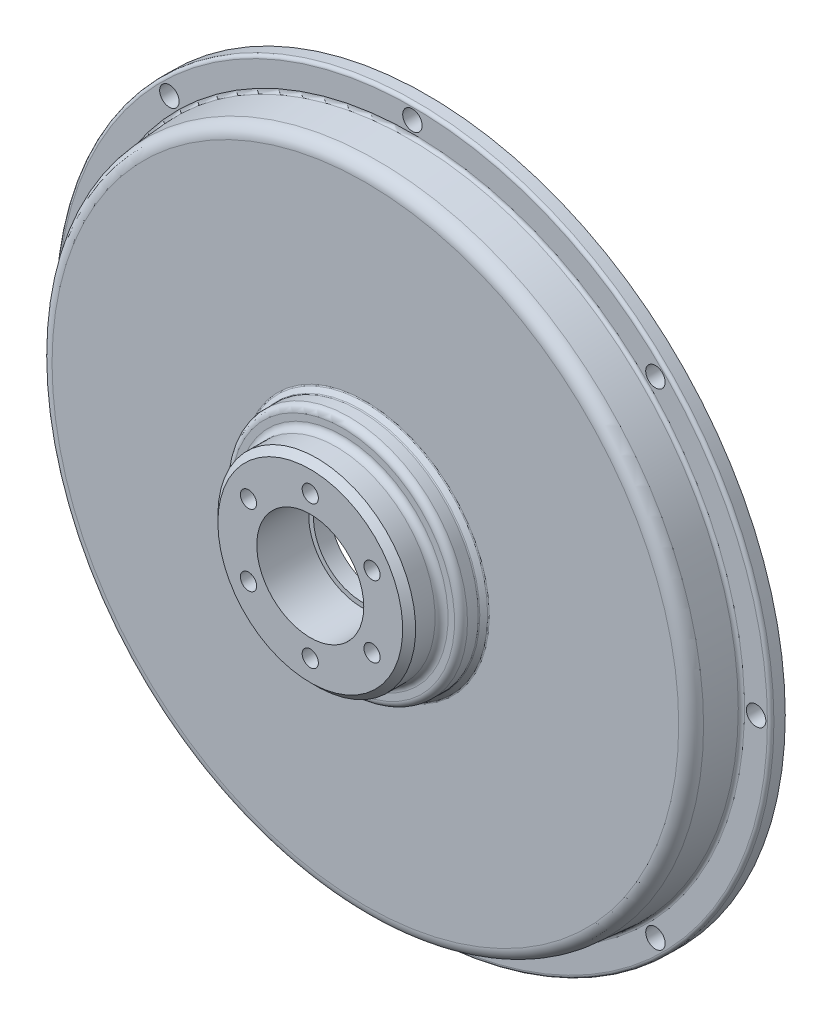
ISO-10303-21;
HEADER;
FILE_DESCRIPTION(('STEP AP214'),'2;1');
FILE_NAME('part.step','',(''),(''),'','','');
FILE_SCHEMA(('AUTOMOTIVE_DESIGN { 1 0 10303 214 1 1 1 1 }'));
ENDSEC;
DATA;
#1=APPLICATION_CONTEXT('core data for automotive mechanical design processes');
#2=APPLICATION_PROTOCOL_DEFINITION('international standard','automotive_design',2000,#1);
#3=PRODUCT_CONTEXT('',#1,'mechanical');
#4=PRODUCT('Part','Part','',(#3));
#5=PRODUCT_RELATED_PRODUCT_CATEGORY('part','',(#4));
#6=PRODUCT_DEFINITION_FORMATION('','',#4);
#7=PRODUCT_DEFINITION_CONTEXT('part definition',#1,'design');
#8=PRODUCT_DEFINITION('design','',#6,#7);
#9=PRODUCT_DEFINITION_SHAPE('','',#8);
#10=(LENGTH_UNIT() NAMED_UNIT(*) SI_UNIT(.MILLI.,.METRE.));
#11=(NAMED_UNIT(*) PLANE_ANGLE_UNIT() SI_UNIT($,.RADIAN.));
#12=(NAMED_UNIT(*) SI_UNIT($,.STERADIAN.) SOLID_ANGLE_UNIT());
#13=UNCERTAINTY_MEASURE_WITH_UNIT(LENGTH_MEASURE(1.E-05),#10,'distance_accuracy_value','');
#14=(GEOMETRIC_REPRESENTATION_CONTEXT(3) GLOBAL_UNCERTAINTY_ASSIGNED_CONTEXT((#13)) GLOBAL_UNIT_ASSIGNED_CONTEXT((#10,
#11,#12)) REPRESENTATION_CONTEXT('',''));
#15=CARTESIAN_POINT('',(0.,0.,0.));
#16=DIRECTION('',(0.,0.,1.));
#17=DIRECTION('',(1.,0.,0.));
#18=AXIS2_PLACEMENT_3D('',#15,#16,#17);
#19=CARTESIAN_POINT('',(-28.5,0.,36.));
#20=DIRECTION('',(0.,0.,1.));
#21=DIRECTION('',(1.,0.,0.));
#22=AXIS2_PLACEMENT_3D('',#19,#20,#21);
#23=PLANE('',#22);
#24=CARTESIAN_POINT('',(0.,22.,36.));
#25=DIRECTION('',(0.,0.,1.));
#26=DIRECTION('',(1.,0.,0.));
#27=AXIS2_PLACEMENT_3D('',#24,#25,#26);
#28=CIRCLE('',#27,2.5);
#29=CARTESIAN_POINT('',(2.5,22.,36.));
#30=VERTEX_POINT('',#29);
#31=EDGE_CURVE('E316',#30,#30,#28,.T.);
#32=ORIENTED_EDGE('',*,*,#31,.F.);
#33=EDGE_LOOP('',(#32));
#34=FACE_BOUND('',#33,.T.);
#35=CARTESIAN_POINT('',(-19.0525588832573,10.9999999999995,36.));
#36=DIRECTION('',(0.,0.,1.));
#37=DIRECTION('',(1.,0.,0.));
#38=AXIS2_PLACEMENT_3D('',#35,#36,#37);
#39=CIRCLE('',#38,2.50000000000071);
#40=CARTESIAN_POINT('',(-16.5525588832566,10.9999999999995,36.));
#41=VERTEX_POINT('',#40);
#42=EDGE_CURVE('E309',#41,#41,#39,.T.);
#43=ORIENTED_EDGE('',*,*,#42,.F.);
#44=EDGE_LOOP('',(#43));
#45=FACE_BOUND('',#44,.T.);
#46=CARTESIAN_POINT('',(-19.0525588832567,-11.0000000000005,36.));
#47=DIRECTION('',(0.,0.,1.));
#48=DIRECTION('',(1.,0.,0.));
#49=AXIS2_PLACEMENT_3D('',#46,#47,#48);
#50=CIRCLE('',#49,2.50000000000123);
#51=CARTESIAN_POINT('',(-16.5525588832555,-11.0000000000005,36.));
#52=VERTEX_POINT('',#51);
#53=EDGE_CURVE('E323',#52,#52,#50,.T.);
#54=ORIENTED_EDGE('',*,*,#53,.F.);
#55=EDGE_LOOP('',(#54));
#56=FACE_BOUND('',#55,.T.);
#57=CARTESIAN_POINT('',(1.23822787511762E-12,-22.,36.));
#58=DIRECTION('',(0.,0.,1.));
#59=DIRECTION('',(1.,0.,0.));
#60=AXIS2_PLACEMENT_3D('',#57,#58,#59);
#61=CIRCLE('',#60,2.50000000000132);
#62=CARTESIAN_POINT('',(2.50000000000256,-22.,36.));
#63=VERTEX_POINT('',#62);
#64=EDGE_CURVE('E340',#63,#63,#61,.T.);
#65=ORIENTED_EDGE('',*,*,#64,.F.);
#66=EDGE_LOOP('',(#65));
#67=FACE_BOUND('',#66,.T.);
#68=CARTESIAN_POINT('',(19.0525588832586,-10.9999999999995,36.));
#69=DIRECTION('',(0.,0.,1.));
#70=DIRECTION('',(1.,0.,0.));
#71=AXIS2_PLACEMENT_3D('',#68,#69,#70);
#72=CIRCLE('',#71,2.50000000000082);
#73=CARTESIAN_POINT('',(21.5525588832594,-10.9999999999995,36.));
#74=VERTEX_POINT('',#73);
#75=EDGE_CURVE('E334',#74,#74,#72,.T.);
#76=ORIENTED_EDGE('',*,*,#75,.F.);
#77=EDGE_LOOP('',(#76));
#78=FACE_BOUND('',#77,.T.);
#79=CARTESIAN_POINT('',(19.052558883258,11.0000000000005,36.));
#80=DIRECTION('',(0.,0.,1.));
#81=DIRECTION('',(1.,0.,0.));
#82=AXIS2_PLACEMENT_3D('',#79,#80,#81);
#83=CIRCLE('',#82,2.50000000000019);
#84=CARTESIAN_POINT('',(21.5525588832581,11.0000000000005,36.));
#85=VERTEX_POINT('',#84);
#86=EDGE_CURVE('E328',#85,#85,#83,.T.);
#87=ORIENTED_EDGE('',*,*,#86,.F.);
#88=EDGE_LOOP('',(#87));
#89=FACE_BOUND('',#88,.T.);
#90=CARTESIAN_POINT('',(0.,0.,36.));
#91=DIRECTION('',(0.,0.,1.));
#92=DIRECTION('',(1.,0.,0.));
#93=AXIS2_PLACEMENT_3D('',#90,#91,#92);
#94=CIRCLE('',#93,16.5);
#95=CARTESIAN_POINT('',(16.5,0.,36.));
#96=VERTEX_POINT('',#95);
#97=EDGE_CURVE('E315',#96,#96,#94,.T.);
#98=ORIENTED_EDGE('',*,*,#97,.F.);
#99=EDGE_LOOP('',(#98));
#100=FACE_BOUND('',#99,.T.);
#101=CARTESIAN_POINT('',(0.,0.,36.));
#102=DIRECTION('',(0.,0.,-1.));
#103=DIRECTION('',(-1.,0.,0.));
#104=AXIS2_PLACEMENT_3D('',#101,#102,#103);
#105=CIRCLE('',#104,28.5);
#106=CARTESIAN_POINT('',(-28.5,0.,36.));
#107=VERTEX_POINT('',#106);
#108=EDGE_CURVE('E114',#107,#107,#105,.T.);
#109=ORIENTED_EDGE('',*,*,#108,.F.);
#110=EDGE_LOOP('',(#109));
#111=FACE_BOUND('',#110,.T.);
#112=ADVANCED_FACE('F30',(#34,#45,#56,#67,#78,#89,#100,#111),#23,.T.);
#113=CARTESIAN_POINT('',(0.,0.,34.));
#114=DIRECTION('',(0.,0.,-1.));
#115=DIRECTION('',(-1.,0.,0.));
#116=AXIS2_PLACEMENT_3D('',#113,#114,#115);
#117=CONICAL_SURFACE('',#116,30.5,0.785398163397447);
#118=ORIENTED_EDGE('',*,*,#108,.T.);
#119=EDGE_LOOP('',(#118));
#120=FACE_BOUND('',#119,.T.);
#121=CARTESIAN_POINT('',(0.,0.,34.));
#122=DIRECTION('',(0.,0.,-1.));
#123=DIRECTION('',(-1.,0.,0.));
#124=AXIS2_PLACEMENT_3D('',#121,#122,#123);
#125=CIRCLE('',#124,30.5);
#126=CARTESIAN_POINT('',(-30.5,0.,34.));
#127=VERTEX_POINT('',#126);
#128=EDGE_CURVE('E111',#127,#127,#125,.T.);
#129=ORIENTED_EDGE('',*,*,#128,.F.);
#130=EDGE_LOOP('',(#129));
#131=FACE_BOUND('',#130,.T.);
#132=ADVANCED_FACE('F138',(#120,#131),#117,.T.);
#133=CARTESIAN_POINT('',(0.,0.,0.));
#134=DIRECTION('',(0.,0.,-1.));
#135=DIRECTION('',(-1.,0.,0.));
#136=AXIS2_PLACEMENT_3D('',#133,#134,#135);
#137=CYLINDRICAL_SURFACE('',#136,30.5);
#138=ORIENTED_EDGE('',*,*,#128,.T.);
#139=EDGE_LOOP('',(#138));
#140=FACE_BOUND('',#139,.T.);
#141=CARTESIAN_POINT('',(0.,0.,28.));
#142=DIRECTION('',(0.,0.,-1.));
#143=DIRECTION('',(-1.,0.,0.));
#144=AXIS2_PLACEMENT_3D('',#141,#142,#143);
#145=CIRCLE('',#144,30.5);
#146=CARTESIAN_POINT('',(-30.5,0.,28.));
#147=VERTEX_POINT('',#146);
#148=EDGE_CURVE('E108',#147,#147,#145,.T.);
#149=ORIENTED_EDGE('',*,*,#148,.F.);
#150=EDGE_LOOP('',(#149));
#151=FACE_BOUND('',#150,.T.);
#152=ADVANCED_FACE('F144',(#140,#151),#137,.T.);
#153=CARTESIAN_POINT('',(0.,0.,28.));
#154=DIRECTION('',(0.,0.,-1.));
#155=DIRECTION('',(-1.,0.,0.));
#156=AXIS2_PLACEMENT_3D('',#153,#154,#155);
#157=TOROIDAL_SURFACE('',#156,32.5,2.);
#158=ORIENTED_EDGE('',*,*,#148,.T.);
#159=EDGE_LOOP('',(#158));
#160=FACE_BOUND('',#159,.T.);
#161=CARTESIAN_POINT('',(0.,0.,26.));
#162=DIRECTION('',(0.,0.,-1.));
#163=DIRECTION('',(-1.,0.,0.));
#164=AXIS2_PLACEMENT_3D('',#161,#162,#163);
#165=CIRCLE('',#164,32.5);
#166=CARTESIAN_POINT('',(-32.5,0.,26.));
#167=VERTEX_POINT('',#166);
#168=EDGE_CURVE('E105',#167,#167,#165,.T.);
#169=ORIENTED_EDGE('',*,*,#168,.F.);
#170=EDGE_LOOP('',(#169));
#171=FACE_BOUND('',#170,.T.);
#172=ADVANCED_FACE('F152',(#160,#171),#157,.F.);
#173=CARTESIAN_POINT('',(-34.5,0.,26.));
#174=DIRECTION('',(0.,0.,1.));
#175=DIRECTION('',(1.,0.,0.));
#176=AXIS2_PLACEMENT_3D('',#173,#174,#175);
#177=PLANE('',#176);
#178=ORIENTED_EDGE('',*,*,#168,.T.);
#179=EDGE_LOOP('',(#178));
#180=FACE_BOUND('',#179,.T.);
#181=CARTESIAN_POINT('',(0.,0.,26.));
#182=DIRECTION('',(0.,0.,-1.));
#183=DIRECTION('',(-1.,0.,0.));
#184=AXIS2_PLACEMENT_3D('',#181,#182,#183);
#185=CIRCLE('',#184,34.5);
#186=CARTESIAN_POINT('',(-34.5,0.,26.));
#187=VERTEX_POINT('',#186);
#188=EDGE_CURVE('E102',#187,#187,#185,.T.);
#189=ORIENTED_EDGE('',*,*,#188,.F.);
#190=EDGE_LOOP('',(#189));
#191=FACE_BOUND('',#190,.T.);
#192=ADVANCED_FACE('F156',(#180,#191),#177,.T.);
#193=CARTESIAN_POINT('',(0.,0.,24.));
#194=DIRECTION('',(0.,0.,-1.));
#195=DIRECTION('',(-1.,0.,0.));
#196=AXIS2_PLACEMENT_3D('',#193,#194,#195);
#197=TOROIDAL_SURFACE('',#196,34.5,2.);
#198=ORIENTED_EDGE('',*,*,#188,.T.);
#199=EDGE_LOOP('',(#198));
#200=FACE_BOUND('',#199,.T.);
#201=CARTESIAN_POINT('',(0.,0.,24.));
#202=DIRECTION('',(0.,0.,-1.));
#203=DIRECTION('',(-1.,0.,0.));
#204=AXIS2_PLACEMENT_3D('',#201,#202,#203);
#205=CIRCLE('',#204,36.5);
#206=CARTESIAN_POINT('',(-36.5,0.,24.));
#207=VERTEX_POINT('',#206);
#208=EDGE_CURVE('E99',#207,#207,#205,.T.);
#209=ORIENTED_EDGE('',*,*,#208,.F.);
#210=EDGE_LOOP('',(#209));
#211=FACE_BOUND('',#210,.T.);
#212=ADVANCED_FACE('F160',(#200,#211),#197,.T.);
#213=CARTESIAN_POINT('',(0.,0.,0.));
#214=DIRECTION('',(0.,0.,-1.));
#215=DIRECTION('',(-1.,0.,0.));
#216=AXIS2_PLACEMENT_3D('',#213,#214,#215);
#217=CYLINDRICAL_SURFACE('',#216,36.5);
#218=CARTESIAN_POINT('',(0.,0.,20.7071067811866));
#219=DIRECTION('',(0.,0.,-1.));
#220=DIRECTION('',(-1.,0.,0.));
#221=AXIS2_PLACEMENT_3D('',#218,#219,#220);
#222=CIRCLE('',#221,36.5);
#223=CARTESIAN_POINT('',(-36.5,0.,20.7071067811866));
#224=VERTEX_POINT('',#223);
#225=EDGE_CURVE('E10',#224,#224,#222,.F.);
#226=ORIENTED_EDGE('',*,*,#225,.T.);
#227=EDGE_LOOP('',(#226));
#228=FACE_BOUND('',#227,.T.);
#229=ORIENTED_EDGE('',*,*,#208,.T.);
#230=EDGE_LOOP('',(#229));
#231=FACE_BOUND('',#230,.T.);
#232=ADVANCED_FACE('F164',(#228,#231),#217,.T.);
#233=CARTESIAN_POINT('',(0.,0.,19.));
#234=DIRECTION('',(0.,0.,-1.));
#235=DIRECTION('',(-1.,0.,0.));
#236=AXIS2_PLACEMENT_3D('',#233,#234,#235);
#237=CONICAL_SURFACE('',#236,38.,0.785398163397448);
#238=CARTESIAN_POINT('',(0.,0.,19.1464466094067));
#239=DIRECTION('',(0.,0.,-1.));
#240=DIRECTION('',(-1.,0.,0.));
#241=AXIS2_PLACEMENT_3D('',#238,#239,#240);
#242=CIRCLE('',#241,37.8535533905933);
#243=CARTESIAN_POINT('',(-37.8535533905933,0.,19.1464466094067));
#244=VERTEX_POINT('',#243);
#245=EDGE_CURVE('E38',#244,#244,#242,.F.);
#246=ORIENTED_EDGE('',*,*,#245,.T.);
#247=EDGE_LOOP('',(#246));
#248=FACE_BOUND('',#247,.T.);
#249=CARTESIAN_POINT('',(0.,0.,20.3535533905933));
#250=DIRECTION('',(0.,0.,-1.));
#251=DIRECTION('',(-1.,0.,0.));
#252=AXIS2_PLACEMENT_3D('',#249,#250,#251);
#253=CIRCLE('',#252,36.6464466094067);
#254=CARTESIAN_POINT('',(-36.6464466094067,0.,20.3535533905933));
#255=VERTEX_POINT('',#254);
#256=EDGE_CURVE('E43',#255,#255,#253,.T.);
#257=ORIENTED_EDGE('',*,*,#256,.T.);
#258=EDGE_LOOP('',(#257));
#259=FACE_BOUND('',#258,.T.);
#260=ADVANCED_FACE('F122',(#248,#259),#237,.T.);
#261=CARTESIAN_POINT('',(-96.6379312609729,0.,19.));
#262=DIRECTION('',(0.,0.,1.));
#263=DIRECTION('',(1.,0.,0.));
#264=AXIS2_PLACEMENT_3D('',#261,#262,#263);
#265=PLANE('',#264);
#266=CARTESIAN_POINT('',(0.,0.,19.));
#267=DIRECTION('',(0.,0.,1.));
#268=DIRECTION('',(1.,0.,0.));
#269=AXIS2_PLACEMENT_3D('',#266,#267,#268);
#270=CIRCLE('',#269,38.2071067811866);
#271=CARTESIAN_POINT('',(38.2071067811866,0.,19.));
#272=VERTEX_POINT('',#271);
#273=EDGE_CURVE('E117',#272,#272,#270,.F.);
#274=ORIENTED_EDGE('',*,*,#273,.T.);
#275=EDGE_LOOP('',(#274));
#276=FACE_BOUND('',#275,.T.);
#277=CARTESIAN_POINT('',(0.,0.,19.));
#278=DIRECTION('',(0.,0.,-1.));
#279=DIRECTION('',(-1.,0.,0.));
#280=AXIS2_PLACEMENT_3D('',#277,#278,#279);
#281=CIRCLE('',#280,96.6379312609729);
#282=CARTESIAN_POINT('',(-96.6379312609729,0.,19.));
#283=VERTEX_POINT('',#282);
#284=EDGE_CURVE('E96',#283,#283,#281,.T.);
#285=ORIENTED_EDGE('',*,*,#284,.F.);
#286=EDGE_LOOP('',(#285));
#287=FACE_BOUND('',#286,.T.);
#288=ADVANCED_FACE('F170',(#276,#287),#265,.T.);
#289=CARTESIAN_POINT('',(0.,0.,15.));
#290=DIRECTION('',(0.,0.,-1.));
#291=DIRECTION('',(-1.,0.,0.));
#292=AXIS2_PLACEMENT_3D('',#289,#290,#291);
#293=TOROIDAL_SURFACE('',#292,96.6379312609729,4.);
#294=ORIENTED_EDGE('',*,*,#284,.T.);
#295=EDGE_LOOP('',(#294));
#296=FACE_BOUND('',#295,.T.);
#297=CARTESIAN_POINT('',(0.,0.,15.3223816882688));
#298=DIRECTION('',(0.,0.,-1.));
#299=DIRECTION('',(-1.,0.,0.));
#300=AXIS2_PLACEMENT_3D('',#297,#298,#299);
#301=CIRCLE('',#300,100.624918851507);
#302=CARTESIAN_POINT('',(-100.624918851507,0.,15.3223816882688));
#303=VERTEX_POINT('',#302);
#304=EDGE_CURVE('E93',#303,#303,#301,.T.);
#305=ORIENTED_EDGE('',*,*,#304,.F.);
#306=EDGE_LOOP('',(#305));
#307=FACE_BOUND('',#306,.T.);
#308=ADVANCED_FACE('F174',(#296,#307),#293,.T.);
#309=CARTESIAN_POINT('',(0.,0.,5.4194045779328));
#310=DIRECTION('',(0.,0.,-1.));
#311=DIRECTION('',(-1.,0.,0.));
#312=AXIS2_PLACEMENT_3D('',#309,#310,#311);
#313=CONICAL_SURFACE('',#312,101.425658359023,0.0806829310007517);
#314=ORIENTED_EDGE('',*,*,#304,.T.);
#315=EDGE_LOOP('',(#314));
#316=FACE_BOUND('',#315,.T.);
#317=CARTESIAN_POINT('',(0.,0.,5.4194045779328));
#318=DIRECTION('',(0.,0.,-1.));
#319=DIRECTION('',(-1.,0.,0.));
#320=AXIS2_PLACEMENT_3D('',#317,#318,#319);
#321=CIRCLE('',#320,101.425658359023);
#322=CARTESIAN_POINT('',(-101.425658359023,0.,5.41940457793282));
#323=VERTEX_POINT('',#322);
#324=EDGE_CURVE('E90',#323,#323,#321,.T.);
#325=ORIENTED_EDGE('',*,*,#324,.F.);
#326=EDGE_LOOP('',(#325));
#327=FACE_BOUND('',#326,.T.);
#328=ADVANCED_FACE('F178',(#316,#327),#313,.T.);
#329=CARTESIAN_POINT('',(0.,0.,5.49999999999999));
#330=DIRECTION('',(0.,0.,-1.));
#331=DIRECTION('',(-1.,0.,0.));
#332=AXIS2_PLACEMENT_3D('',#329,#330,#331);
#333=TOROIDAL_SURFACE('',#332,102.422405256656,1.);
#334=ORIENTED_EDGE('',*,*,#324,.T.);
#335=EDGE_LOOP('',(#334));
#336=FACE_BOUND('',#335,.T.);
#337=CARTESIAN_POINT('',(0.,0.,4.49999999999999));
#338=DIRECTION('',(0.,0.,-1.));
#339=DIRECTION('',(-1.,0.,0.));
#340=AXIS2_PLACEMENT_3D('',#337,#338,#339);
#341=CIRCLE('',#340,102.422405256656);
#342=CARTESIAN_POINT('',(-102.422405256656,0.,4.50000000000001));
#343=VERTEX_POINT('',#342);
#344=EDGE_CURVE('E87',#343,#343,#341,.T.);
#345=ORIENTED_EDGE('',*,*,#344,.F.);
#346=EDGE_LOOP('',(#345));
#347=FACE_BOUND('',#346,.T.);
#348=ADVANCED_FACE('F182',(#336,#347),#333,.F.);
#349=CARTESIAN_POINT('',(-109.5,0.,4.50000000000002));
#350=DIRECTION('',(0.,0.,1.));
#351=DIRECTION('',(1.,0.,0.));
#352=AXIS2_PLACEMENT_3D('',#349,#350,#351);
#353=PLANE('',#352);
#354=CARTESIAN_POINT('',(0.,106.,4.49999999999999));
#355=DIRECTION('',(0.,0.,1.));
#356=DIRECTION('',(1.,0.,0.));
#357=AXIS2_PLACEMENT_3D('',#354,#355,#356);
#358=CIRCLE('',#357,3.);
#359=CARTESIAN_POINT('',(3.,106.,4.49999999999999));
#360=VERTEX_POINT('',#359);
#361=EDGE_CURVE('E51',#360,#360,#358,.T.);
#362=ORIENTED_EDGE('',*,*,#361,.F.);
#363=EDGE_LOOP('',(#362));
#364=FACE_BOUND('',#363,.T.);
#365=CARTESIAN_POINT('',(74.9533188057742,74.9533188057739,4.49999999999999));
#366=DIRECTION('',(0.,0.,1.));
#367=DIRECTION('',(1.,0.,0.));
#368=AXIS2_PLACEMENT_3D('',#365,#366,#367);
#369=CIRCLE('',#368,2.99999999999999);
#370=CARTESIAN_POINT('',(77.9533188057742,74.9533188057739,4.49999999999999));
#371=VERTEX_POINT('',#370);
#372=EDGE_CURVE('E355',#371,#371,#369,.T.);
#373=ORIENTED_EDGE('',*,*,#372,.F.);
#374=EDGE_LOOP('',(#373));
#375=FACE_BOUND('',#374,.T.);
#376=CARTESIAN_POINT('',(106.,-3.70097021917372E-13,4.49999999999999));
#377=DIRECTION('',(0.,0.,1.));
#378=DIRECTION('',(1.,0.,0.));
#379=AXIS2_PLACEMENT_3D('',#376,#377,#378);
#380=CIRCLE('',#379,3.);
#381=CARTESIAN_POINT('',(109.,-3.70097021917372E-13,4.49999999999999));
#382=VERTEX_POINT('',#381);
#383=EDGE_CURVE('E358',#382,#382,#380,.T.);
#384=ORIENTED_EDGE('',*,*,#383,.F.);
#385=EDGE_LOOP('',(#384));
#386=FACE_BOUND('',#385,.T.);
#387=CARTESIAN_POINT('',(74.9533188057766,-74.953318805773,4.49999999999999));
#388=DIRECTION('',(0.,0.,1.));
#389=DIRECTION('',(1.,0.,0.));
#390=AXIS2_PLACEMENT_3D('',#387,#388,#389);
#391=CIRCLE('',#390,3.00000000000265);
#392=CARTESIAN_POINT('',(77.9533188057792,-74.953318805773,4.49999999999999));
#393=VERTEX_POINT('',#392);
#394=EDGE_CURVE('E361',#393,#393,#391,.T.);
#395=ORIENTED_EDGE('',*,*,#394,.F.);
#396=EDGE_LOOP('',(#395));
#397=FACE_BOUND('',#396,.T.);
#398=CARTESIAN_POINT('',(2.98760604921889E-12,-106.,4.49999999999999));
#399=DIRECTION('',(0.,0.,1.));
#400=DIRECTION('',(1.,0.,0.));
#401=AXIS2_PLACEMENT_3D('',#398,#399,#400);
#402=CIRCLE('',#401,3.00000000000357);
#403=CARTESIAN_POINT('',(3.00000000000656,-106.,4.49999999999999));
#404=VERTEX_POINT('',#403);
#405=EDGE_CURVE('E364',#404,#404,#402,.T.);
#406=ORIENTED_EDGE('',*,*,#405,.F.);
#407=EDGE_LOOP('',(#406));
#408=FACE_BOUND('',#407,.T.);
#409=CARTESIAN_POINT('',(-74.9533188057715,-74.9533188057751,4.49999999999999));
#410=DIRECTION('',(0.,0.,1.));
#411=DIRECTION('',(1.,0.,0.));
#412=AXIS2_PLACEMENT_3D('',#409,#410,#411);
#413=CIRCLE('',#412,3.00000000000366);
#414=CARTESIAN_POINT('',(-71.9533188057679,-74.9533188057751,4.49999999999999));
#415=VERTEX_POINT('',#414);
#416=EDGE_CURVE('E367',#415,#415,#413,.T.);
#417=ORIENTED_EDGE('',*,*,#416,.F.);
#418=EDGE_LOOP('',(#417));
#419=FACE_BOUND('',#418,.T.);
#420=CARTESIAN_POINT('',(-105.999999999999,-1.50635059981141E-12,4.49999999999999));
#421=DIRECTION('',(0.,0.,1.));
#422=DIRECTION('',(1.,0.,0.));
#423=AXIS2_PLACEMENT_3D('',#420,#421,#422);
#424=CIRCLE('',#423,3.00000000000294);
#425=CARTESIAN_POINT('',(-102.999999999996,-1.50635059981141E-12,4.49999999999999));
#426=VERTEX_POINT('',#425);
#427=EDGE_CURVE('E369',#426,#426,#424,.T.);
#428=ORIENTED_EDGE('',*,*,#427,.F.);
#429=EDGE_LOOP('',(#428));
#430=FACE_BOUND('',#429,.T.);
#431=CARTESIAN_POINT('',(-74.9533188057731,74.953318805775,4.49999999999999));
#432=DIRECTION('',(0.,0.,1.));
#433=DIRECTION('',(1.,0.,0.));
#434=AXIS2_PLACEMENT_3D('',#431,#432,#433);
#435=CIRCLE('',#434,3.);
#436=CARTESIAN_POINT('',(-71.9533188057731,74.953318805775,4.49999999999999));
#437=VERTEX_POINT('',#436);
#438=EDGE_CURVE('E82',#437,#437,#435,.T.);
#439=ORIENTED_EDGE('',*,*,#438,.F.);
#440=EDGE_LOOP('',(#439));
#441=FACE_BOUND('',#440,.T.);
#442=ORIENTED_EDGE('',*,*,#344,.T.);
#443=EDGE_LOOP('',(#442));
#444=FACE_BOUND('',#443,.T.);
#445=CARTESIAN_POINT('',(0.,0.,4.49999999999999));
#446=DIRECTION('',(0.,0.,-1.));
#447=DIRECTION('',(-1.,0.,0.));
#448=AXIS2_PLACEMENT_3D('',#445,#446,#447);
#449=CIRCLE('',#448,109.5);
#450=CARTESIAN_POINT('',(-109.5,0.,4.50000000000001));
#451=VERTEX_POINT('',#450);
#452=EDGE_CURVE('E79',#451,#451,#449,.T.);
#453=ORIENTED_EDGE('',*,*,#452,.F.);
#454=EDGE_LOOP('',(#453));
#455=FACE_BOUND('',#454,.T.);
#456=ADVANCED_FACE('F186',(#364,#375,#386,#397,#408,#419,#430,#441,#444,#455),#353,.T.);
#457=CARTESIAN_POINT('',(0.,0.,3.49999999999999));
#458=DIRECTION('',(0.,0.,-1.));
#459=DIRECTION('',(-1.,0.,0.));
#460=AXIS2_PLACEMENT_3D('',#457,#458,#459);
#461=TOROIDAL_SURFACE('',#460,109.5,1.);
#462=ORIENTED_EDGE('',*,*,#452,.T.);
#463=EDGE_LOOP('',(#462));
#464=FACE_BOUND('',#463,.T.);
#465=CARTESIAN_POINT('',(0.,0.,3.49999999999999));
#466=DIRECTION('',(0.,0.,-1.));
#467=DIRECTION('',(-1.,0.,0.));
#468=AXIS2_PLACEMENT_3D('',#465,#466,#467);
#469=CIRCLE('',#468,110.5);
#470=CARTESIAN_POINT('',(-110.5,0.,3.50000000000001));
#471=VERTEX_POINT('',#470);
#472=EDGE_CURVE('E74',#471,#471,#469,.T.);
#473=ORIENTED_EDGE('',*,*,#472,.F.);
#474=EDGE_LOOP('',(#473));
#475=FACE_BOUND('',#474,.T.);
#476=ADVANCED_FACE('F190',(#464,#475),#461,.T.);
#477=CARTESIAN_POINT('',(0.,0.,0.));
#478=DIRECTION('',(0.,0.,-1.));
#479=DIRECTION('',(-1.,0.,0.));
#480=AXIS2_PLACEMENT_3D('',#477,#478,#479);
#481=CYLINDRICAL_SURFACE('',#480,110.5);
#482=ORIENTED_EDGE('',*,*,#472,.T.);
#483=EDGE_LOOP('',(#482));
#484=FACE_BOUND('',#483,.T.);
#485=CARTESIAN_POINT('',(0.,0.,0.));
#486=DIRECTION('',(0.,0.,-1.));
#487=DIRECTION('',(-1.,0.,0.));
#488=AXIS2_PLACEMENT_3D('',#485,#486,#487);
#489=CIRCLE('',#488,110.5);
#490=CARTESIAN_POINT('',(-110.5,0.,0.));
#491=VERTEX_POINT('',#490);
#492=EDGE_CURVE('E70',#491,#491,#489,.T.);
#493=ORIENTED_EDGE('',*,*,#492,.F.);
#494=EDGE_LOOP('',(#493));
#495=FACE_BOUND('',#494,.T.);
#496=ADVANCED_FACE('F194',(#484,#495),#481,.T.);
#497=CARTESIAN_POINT('',(-110.5,0.,0.));
#498=DIRECTION('',(0.,0.,-1.));
#499=DIRECTION('',(-1.,0.,0.));
#500=AXIS2_PLACEMENT_3D('',#497,#498,#499);
#501=PLANE('',#500);
#502=CARTESIAN_POINT('',(0.,0.,0.));
#503=DIRECTION('',(0.,0.,-1.));
#504=DIRECTION('',(-1.,0.,0.));
#505=AXIS2_PLACEMENT_3D('',#502,#503,#504);
#506=CIRCLE('',#505,95.);
#507=CARTESIAN_POINT('',(-95.,0.,0.));
#508=VERTEX_POINT('',#507);
#509=EDGE_CURVE('E304',#508,#508,#506,.T.);
#510=ORIENTED_EDGE('',*,*,#509,.F.);
#511=EDGE_LOOP('',(#510));
#512=FACE_BOUND('',#511,.T.);
#513=CARTESIAN_POINT('',(0.,106.,0.));
#514=DIRECTION('',(0.,0.,-1.));
#515=DIRECTION('',(-1.,0.,0.));
#516=AXIS2_PLACEMENT_3D('',#513,#514,#515);
#517=CIRCLE('',#516,3.);
#518=CARTESIAN_POINT('',(-3.,106.,0.));
#519=VERTEX_POINT('',#518);
#520=EDGE_CURVE('E68',#519,#519,#517,.T.);
#521=ORIENTED_EDGE('',*,*,#520,.F.);
#522=EDGE_LOOP('',(#521));
#523=FACE_BOUND('',#522,.T.);
#524=CARTESIAN_POINT('',(74.9533188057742,74.9533188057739,0.));
#525=DIRECTION('',(0.,0.,-1.));
#526=DIRECTION('',(-1.,0.,0.));
#527=AXIS2_PLACEMENT_3D('',#524,#525,#526);
#528=CIRCLE('',#527,2.99999999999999);
#529=CARTESIAN_POINT('',(71.9533188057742,74.9533188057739,0.));
#530=VERTEX_POINT('',#529);
#531=EDGE_CURVE('E66',#530,#530,#528,.T.);
#532=ORIENTED_EDGE('',*,*,#531,.F.);
#533=EDGE_LOOP('',(#532));
#534=FACE_BOUND('',#533,.T.);
#535=CARTESIAN_POINT('',(106.,-3.70097021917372E-13,0.));
#536=DIRECTION('',(0.,0.,-1.));
#537=DIRECTION('',(-1.,0.,0.));
#538=AXIS2_PLACEMENT_3D('',#535,#536,#537);
#539=CIRCLE('',#538,3.);
#540=CARTESIAN_POINT('',(103.,-3.70097021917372E-13,0.));
#541=VERTEX_POINT('',#540);
#542=EDGE_CURVE('E63',#541,#541,#539,.T.);
#543=ORIENTED_EDGE('',*,*,#542,.F.);
#544=EDGE_LOOP('',(#543));
#545=FACE_BOUND('',#544,.T.);
#546=CARTESIAN_POINT('',(74.9533188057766,-74.953318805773,0.));
#547=DIRECTION('',(0.,0.,-1.));
#548=DIRECTION('',(-1.,0.,0.));
#549=AXIS2_PLACEMENT_3D('',#546,#547,#548);
#550=CIRCLE('',#549,3.00000000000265);
#551=CARTESIAN_POINT('',(71.9533188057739,-74.953318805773,0.));
#552=VERTEX_POINT('',#551);
#553=EDGE_CURVE('E60',#552,#552,#550,.T.);
#554=ORIENTED_EDGE('',*,*,#553,.F.);
#555=EDGE_LOOP('',(#554));
#556=FACE_BOUND('',#555,.T.);
#557=CARTESIAN_POINT('',(2.98760604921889E-12,-106.,0.));
#558=DIRECTION('',(0.,0.,-1.));
#559=DIRECTION('',(-1.,0.,0.));
#560=AXIS2_PLACEMENT_3D('',#557,#558,#559);
#561=CIRCLE('',#560,3.00000000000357);
#562=CARTESIAN_POINT('',(-3.00000000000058,-106.,0.));
#563=VERTEX_POINT('',#562);
#564=EDGE_CURVE('E57',#563,#563,#561,.T.);
#565=ORIENTED_EDGE('',*,*,#564,.F.);
#566=EDGE_LOOP('',(#565));
#567=FACE_BOUND('',#566,.T.);
#568=CARTESIAN_POINT('',(-74.9533188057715,-74.9533188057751,0.));
#569=DIRECTION('',(0.,0.,-1.));
#570=DIRECTION('',(-1.,0.,0.));
#571=AXIS2_PLACEMENT_3D('',#568,#569,#570);
#572=CIRCLE('',#571,3.00000000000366);
#573=CARTESIAN_POINT('',(-77.9533188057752,-74.9533188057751,0.));
#574=VERTEX_POINT('',#573);
#575=EDGE_CURVE('E54',#574,#574,#572,.T.);
#576=ORIENTED_EDGE('',*,*,#575,.F.);
#577=EDGE_LOOP('',(#576));
#578=FACE_BOUND('',#577,.T.);
#579=CARTESIAN_POINT('',(-105.999999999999,-1.50635059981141E-12,0.));
#580=DIRECTION('',(0.,0.,-1.));
#581=DIRECTION('',(-1.,0.,0.));
#582=AXIS2_PLACEMENT_3D('',#579,#580,#581);
#583=CIRCLE('',#582,3.00000000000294);
#584=CARTESIAN_POINT('',(-109.000000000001,-1.50635059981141E-12,0.));
#585=VERTEX_POINT('',#584);
#586=EDGE_CURVE('E50',#585,#585,#583,.T.);
#587=ORIENTED_EDGE('',*,*,#586,.F.);
#588=EDGE_LOOP('',(#587));
#589=FACE_BOUND('',#588,.T.);
#590=CARTESIAN_POINT('',(-74.9533188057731,74.953318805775,0.));
#591=DIRECTION('',(0.,0.,-1.));
#592=DIRECTION('',(-1.,0.,0.));
#593=AXIS2_PLACEMENT_3D('',#590,#591,#592);
#594=CIRCLE('',#593,3.);
#595=CARTESIAN_POINT('',(-77.9533188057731,74.953318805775,0.));
#596=VERTEX_POINT('',#595);
#597=EDGE_CURVE('E47',#596,#596,#594,.T.);
#598=ORIENTED_EDGE('',*,*,#597,.F.);
#599=EDGE_LOOP('',(#598));
#600=FACE_BOUND('',#599,.T.);
#601=ORIENTED_EDGE('',*,*,#492,.T.);
#602=EDGE_LOOP('',(#601));
#603=FACE_BOUND('',#602,.T.);
#604=ADVANCED_FACE('F135',(#512,#523,#534,#545,#556,#567,#578,#589,#600,#603),#501,.T.);
#605=CARTESIAN_POINT('',(0.,0.,19.5));
#606=DIRECTION('',(0.,0.,1.));
#607=DIRECTION('',(1.,0.,0.));
#608=AXIS2_PLACEMENT_3D('',#605,#606,#607);
#609=TOROIDAL_SURFACE('',#608,38.2071067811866,0.5);
#610=ORIENTED_EDGE('',*,*,#245,.F.);
#611=EDGE_LOOP('',(#610));
#612=FACE_BOUND('',#611,.T.);
#613=ORIENTED_EDGE('',*,*,#273,.F.);
#614=EDGE_LOOP('',(#613));
#615=FACE_BOUND('',#614,.T.);
#616=ADVANCED_FACE('F126',(#612,#615),#609,.F.);
#617=CARTESIAN_POINT('',(0.,0.,20.7071067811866));
#618=DIRECTION('',(0.,0.,-1.));
#619=DIRECTION('',(-1.,0.,0.));
#620=AXIS2_PLACEMENT_3D('',#617,#618,#619);
#621=TOROIDAL_SURFACE('',#620,37.,0.5);
#622=ORIENTED_EDGE('',*,*,#225,.F.);
#623=EDGE_LOOP('',(#622));
#624=FACE_BOUND('',#623,.T.);
#625=ORIENTED_EDGE('',*,*,#256,.F.);
#626=EDGE_LOOP('',(#625));
#627=FACE_BOUND('',#626,.T.);
#628=ADVANCED_FACE('F32',(#624,#627),#621,.F.);
#629=CARTESIAN_POINT('',(-74.9533188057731,74.953318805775,-5.50000000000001));
#630=DIRECTION('',(0.,0.,1.));
#631=DIRECTION('',(1.,0.,0.));
#632=AXIS2_PLACEMENT_3D('',#629,#630,#631);
#633=CYLINDRICAL_SURFACE('',#632,3.);
#634=ORIENTED_EDGE('',*,*,#597,.T.);
#635=EDGE_LOOP('',(#634));
#636=FACE_BOUND('',#635,.T.);
#637=ORIENTED_EDGE('',*,*,#438,.T.);
#638=EDGE_LOOP('',(#637));
#639=FACE_BOUND('',#638,.T.);
#640=ADVANCED_FACE('F125',(#636,#639),#633,.F.);
#641=CARTESIAN_POINT('',(-105.999999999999,-1.50635059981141E-12,-5.50000000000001));
#642=DIRECTION('',(0.,0.,1.));
#643=DIRECTION('',(1.,0.,0.));
#644=AXIS2_PLACEMENT_3D('',#641,#642,#643);
#645=CYLINDRICAL_SURFACE('',#644,3.00000000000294);
#646=ORIENTED_EDGE('',*,*,#586,.T.);
#647=EDGE_LOOP('',(#646));
#648=FACE_BOUND('',#647,.T.);
#649=ORIENTED_EDGE('',*,*,#427,.T.);
#650=EDGE_LOOP('',(#649));
#651=FACE_BOUND('',#650,.T.);
#652=ADVANCED_FACE('F132',(#648,#651),#645,.F.);
#653=CARTESIAN_POINT('',(-74.9533188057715,-74.9533188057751,-5.50000000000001));
#654=DIRECTION('',(0.,0.,1.));
#655=DIRECTION('',(1.,0.,0.));
#656=AXIS2_PLACEMENT_3D('',#653,#654,#655);
#657=CYLINDRICAL_SURFACE('',#656,3.00000000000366);
#658=ORIENTED_EDGE('',*,*,#575,.T.);
#659=EDGE_LOOP('',(#658));
#660=FACE_BOUND('',#659,.T.);
#661=ORIENTED_EDGE('',*,*,#416,.T.);
#662=EDGE_LOOP('',(#661));
#663=FACE_BOUND('',#662,.T.);
#664=ADVANCED_FACE('F204',(#660,#663),#657,.F.);
#665=CARTESIAN_POINT('',(2.98760604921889E-12,-106.,-5.50000000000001));
#666=DIRECTION('',(0.,0.,1.));
#667=DIRECTION('',(1.,0.,0.));
#668=AXIS2_PLACEMENT_3D('',#665,#666,#667);
#669=CYLINDRICAL_SURFACE('',#668,3.00000000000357);
#670=ORIENTED_EDGE('',*,*,#564,.T.);
#671=EDGE_LOOP('',(#670));
#672=FACE_BOUND('',#671,.T.);
#673=ORIENTED_EDGE('',*,*,#405,.T.);
#674=EDGE_LOOP('',(#673));
#675=FACE_BOUND('',#674,.T.);
#676=ADVANCED_FACE('F208',(#672,#675),#669,.F.);
#677=CARTESIAN_POINT('',(74.9533188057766,-74.953318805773,-5.50000000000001));
#678=DIRECTION('',(0.,0.,1.));
#679=DIRECTION('',(1.,0.,0.));
#680=AXIS2_PLACEMENT_3D('',#677,#678,#679);
#681=CYLINDRICAL_SURFACE('',#680,3.00000000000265);
#682=ORIENTED_EDGE('',*,*,#553,.T.);
#683=EDGE_LOOP('',(#682));
#684=FACE_BOUND('',#683,.T.);
#685=ORIENTED_EDGE('',*,*,#394,.T.);
#686=EDGE_LOOP('',(#685));
#687=FACE_BOUND('',#686,.T.);
#688=ADVANCED_FACE('F212',(#684,#687),#681,.F.);
#689=CARTESIAN_POINT('',(106.,-3.70097021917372E-13,-5.50000000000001));
#690=DIRECTION('',(0.,0.,1.));
#691=DIRECTION('',(1.,0.,0.));
#692=AXIS2_PLACEMENT_3D('',#689,#690,#691);
#693=CYLINDRICAL_SURFACE('',#692,3.);
#694=ORIENTED_EDGE('',*,*,#542,.T.);
#695=EDGE_LOOP('',(#694));
#696=FACE_BOUND('',#695,.T.);
#697=ORIENTED_EDGE('',*,*,#383,.T.);
#698=EDGE_LOOP('',(#697));
#699=FACE_BOUND('',#698,.T.);
#700=ADVANCED_FACE('F216',(#696,#699),#693,.F.);
#701=CARTESIAN_POINT('',(74.9533188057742,74.9533188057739,-5.50000000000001));
#702=DIRECTION('',(0.,0.,1.));
#703=DIRECTION('',(1.,0.,0.));
#704=AXIS2_PLACEMENT_3D('',#701,#702,#703);
#705=CYLINDRICAL_SURFACE('',#704,2.99999999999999);
#706=ORIENTED_EDGE('',*,*,#531,.T.);
#707=EDGE_LOOP('',(#706));
#708=FACE_BOUND('',#707,.T.);
#709=ORIENTED_EDGE('',*,*,#372,.T.);
#710=EDGE_LOOP('',(#709));
#711=FACE_BOUND('',#710,.T.);
#712=ADVANCED_FACE('F220',(#708,#711),#705,.F.);
#713=CARTESIAN_POINT('',(0.,106.,-5.50000000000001));
#714=DIRECTION('',(0.,0.,1.));
#715=DIRECTION('',(1.,0.,0.));
#716=AXIS2_PLACEMENT_3D('',#713,#714,#715);
#717=CYLINDRICAL_SURFACE('',#716,3.);
#718=ORIENTED_EDGE('',*,*,#520,.T.);
#719=EDGE_LOOP('',(#718));
#720=FACE_BOUND('',#719,.T.);
#721=ORIENTED_EDGE('',*,*,#361,.T.);
#722=EDGE_LOOP('',(#721));
#723=FACE_BOUND('',#722,.T.);
#724=ADVANCED_FACE('F224',(#720,#723),#717,.F.);
#725=CARTESIAN_POINT('',(0.,0.,20.));
#726=DIRECTION('',(0.,0.,1.));
#727=DIRECTION('',(1.,0.,0.));
#728=AXIS2_PLACEMENT_3D('',#725,#726,#727);
#729=CYLINDRICAL_SURFACE('',#728,16.5);
#730=CARTESIAN_POINT('',(0.,0.,20.));
#731=DIRECTION('',(0.,0.,1.));
#732=DIRECTION('',(1.,0.,0.));
#733=AXIS2_PLACEMENT_3D('',#730,#731,#732);
#734=CIRCLE('',#733,16.5);
#735=CARTESIAN_POINT('',(16.5,0.,20.));
#736=VERTEX_POINT('',#735);
#737=EDGE_CURVE('E348',#736,#736,#734,.T.);
#738=ORIENTED_EDGE('',*,*,#737,.F.);
#739=EDGE_LOOP('',(#738));
#740=FACE_BOUND('',#739,.T.);
#741=ORIENTED_EDGE('',*,*,#97,.T.);
#742=EDGE_LOOP('',(#741));
#743=FACE_BOUND('',#742,.T.);
#744=ADVANCED_FACE('F228',(#740,#743),#729,.F.);
#745=CARTESIAN_POINT('',(0.,0.,20.));
#746=DIRECTION('',(0.,0.,1.));
#747=DIRECTION('',(1.,0.,0.));
#748=AXIS2_PLACEMENT_3D('',#745,#746,#747);
#749=PLANE('',#748);
#750=CARTESIAN_POINT('',(0.,0.,20.));
#751=DIRECTION('',(0.,0.,1.));
#752=DIRECTION('',(1.,0.,0.));
#753=AXIS2_PLACEMENT_3D('',#750,#751,#752);
#754=CIRCLE('',#753,15.);
#755=CARTESIAN_POINT('',(15.,0.,20.));
#756=VERTEX_POINT('',#755);
#757=EDGE_CURVE('E302',#756,#756,#754,.T.);
#758=ORIENTED_EDGE('',*,*,#757,.F.);
#759=EDGE_LOOP('',(#758));
#760=FACE_BOUND('',#759,.T.);
#761=ORIENTED_EDGE('',*,*,#737,.T.);
#762=EDGE_LOOP('',(#761));
#763=FACE_BOUND('',#762,.T.);
#764=ADVANCED_FACE('F231',(#760,#763),#749,.T.);
#765=CARTESIAN_POINT('',(19.052558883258,11.0000000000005,21.));
#766=DIRECTION('',(0.,0.,1.));
#767=DIRECTION('',(1.,0.,0.));
#768=AXIS2_PLACEMENT_3D('',#765,#766,#767);
#769=CYLINDRICAL_SURFACE('',#768,2.50000000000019);
#770=CARTESIAN_POINT('',(19.052558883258,11.0000000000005,21.));
#771=DIRECTION('',(0.,0.,1.));
#772=DIRECTION('',(1.,0.,0.));
#773=AXIS2_PLACEMENT_3D('',#770,#771,#772);
#774=CIRCLE('',#773,2.50000000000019);
#775=CARTESIAN_POINT('',(21.5525588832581,11.0000000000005,21.));
#776=VERTEX_POINT('',#775);
#777=EDGE_CURVE('E319',#776,#776,#774,.T.);
#778=ORIENTED_EDGE('',*,*,#777,.F.);
#779=EDGE_LOOP('',(#778));
#780=FACE_BOUND('',#779,.T.);
#781=ORIENTED_EDGE('',*,*,#86,.T.);
#782=EDGE_LOOP('',(#781));
#783=FACE_BOUND('',#782,.T.);
#784=ADVANCED_FACE('F235',(#780,#783),#769,.F.);
#785=CARTESIAN_POINT('',(19.052558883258,11.0000000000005,21.));
#786=DIRECTION('',(0.,0.,1.));
#787=DIRECTION('',(1.,0.,0.));
#788=AXIS2_PLACEMENT_3D('',#785,#786,#787);
#789=PLANE('',#788);
#790=ORIENTED_EDGE('',*,*,#777,.T.);
#791=EDGE_LOOP('',(#790));
#792=FACE_BOUND('',#791,.T.);
#793=ADVANCED_FACE('F258',(#792),#789,.T.);
#794=CARTESIAN_POINT('',(19.0525588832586,-10.9999999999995,21.));
#795=DIRECTION('',(0.,0.,1.));
#796=DIRECTION('',(1.,0.,0.));
#797=AXIS2_PLACEMENT_3D('',#794,#795,#796);
#798=CYLINDRICAL_SURFACE('',#797,2.50000000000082);
#799=CARTESIAN_POINT('',(19.0525588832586,-10.9999999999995,21.));
#800=DIRECTION('',(0.,0.,1.));
#801=DIRECTION('',(1.,0.,0.));
#802=AXIS2_PLACEMENT_3D('',#799,#800,#801);
#803=CIRCLE('',#802,2.50000000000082);
#804=CARTESIAN_POINT('',(21.5525588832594,-10.9999999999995,21.));
#805=VERTEX_POINT('',#804);
#806=EDGE_CURVE('E331',#805,#805,#803,.T.);
#807=ORIENTED_EDGE('',*,*,#806,.F.);
#808=EDGE_LOOP('',(#807));
#809=FACE_BOUND('',#808,.T.);
#810=ORIENTED_EDGE('',*,*,#75,.T.);
#811=EDGE_LOOP('',(#810));
#812=FACE_BOUND('',#811,.T.);
#813=ADVANCED_FACE('F255',(#809,#812),#798,.F.);
#814=CARTESIAN_POINT('',(19.0525588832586,-10.9999999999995,21.));
#815=DIRECTION('',(0.,0.,1.));
#816=DIRECTION('',(1.,0.,0.));
#817=AXIS2_PLACEMENT_3D('',#814,#815,#816);
#818=PLANE('',#817);
#819=ORIENTED_EDGE('',*,*,#806,.T.);
#820=EDGE_LOOP('',(#819));
#821=FACE_BOUND('',#820,.T.);
#822=ADVANCED_FACE('F250',(#821),#818,.T.);
#823=CARTESIAN_POINT('',(1.23822787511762E-12,-22.,21.));
#824=DIRECTION('',(0.,0.,1.));
#825=DIRECTION('',(1.,0.,0.));
#826=AXIS2_PLACEMENT_3D('',#823,#824,#825);
#827=CYLINDRICAL_SURFACE('',#826,2.50000000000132);
#828=CARTESIAN_POINT('',(1.23822787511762E-12,-22.,21.));
#829=DIRECTION('',(0.,0.,1.));
#830=DIRECTION('',(1.,0.,0.));
#831=AXIS2_PLACEMENT_3D('',#828,#829,#830);
#832=CIRCLE('',#831,2.50000000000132);
#833=CARTESIAN_POINT('',(2.50000000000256,-22.,21.));
#834=VERTEX_POINT('',#833);
#835=EDGE_CURVE('E337',#834,#834,#832,.T.);
#836=ORIENTED_EDGE('',*,*,#835,.F.);
#837=EDGE_LOOP('',(#836));
#838=FACE_BOUND('',#837,.T.);
#839=ORIENTED_EDGE('',*,*,#64,.T.);
#840=EDGE_LOOP('',(#839));
#841=FACE_BOUND('',#840,.T.);
#842=ADVANCED_FACE('F247',(#838,#841),#827,.F.);
#843=CARTESIAN_POINT('',(1.23822787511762E-12,-22.,21.));
#844=DIRECTION('',(0.,0.,1.));
#845=DIRECTION('',(1.,0.,0.));
#846=AXIS2_PLACEMENT_3D('',#843,#844,#845);
#847=PLANE('',#846);
#848=ORIENTED_EDGE('',*,*,#835,.T.);
#849=EDGE_LOOP('',(#848));
#850=FACE_BOUND('',#849,.T.);
#851=ADVANCED_FACE('F241',(#850),#847,.T.);
#852=CARTESIAN_POINT('',(-19.0525588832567,-11.0000000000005,21.));
#853=DIRECTION('',(0.,0.,1.));
#854=DIRECTION('',(1.,0.,0.));
#855=AXIS2_PLACEMENT_3D('',#852,#853,#854);
#856=CYLINDRICAL_SURFACE('',#855,2.50000000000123);
#857=CARTESIAN_POINT('',(-19.0525588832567,-11.0000000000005,21.));
#858=DIRECTION('',(0.,0.,1.));
#859=DIRECTION('',(1.,0.,0.));
#860=AXIS2_PLACEMENT_3D('',#857,#858,#859);
#861=CIRCLE('',#860,2.50000000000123);
#862=CARTESIAN_POINT('',(-16.5525588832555,-11.0000000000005,21.));
#863=VERTEX_POINT('',#862);
#864=EDGE_CURVE('E343',#863,#863,#861,.T.);
#865=ORIENTED_EDGE('',*,*,#864,.F.);
#866=EDGE_LOOP('',(#865));
#867=FACE_BOUND('',#866,.T.);
#868=ORIENTED_EDGE('',*,*,#53,.T.);
#869=EDGE_LOOP('',(#868));
#870=FACE_BOUND('',#869,.T.);
#871=ADVANCED_FACE('F237',(#867,#870),#856,.F.);
#872=CARTESIAN_POINT('',(-19.0525588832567,-11.0000000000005,21.));
#873=DIRECTION('',(0.,0.,1.));
#874=DIRECTION('',(1.,0.,0.));
#875=AXIS2_PLACEMENT_3D('',#872,#873,#874);
#876=PLANE('',#875);
#877=ORIENTED_EDGE('',*,*,#864,.T.);
#878=EDGE_LOOP('',(#877));
#879=FACE_BOUND('',#878,.T.);
#880=ADVANCED_FACE('F240',(#879),#876,.T.);
#881=CARTESIAN_POINT('',(-19.0525588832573,10.9999999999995,21.));
#882=DIRECTION('',(0.,0.,1.));
#883=DIRECTION('',(1.,0.,0.));
#884=AXIS2_PLACEMENT_3D('',#881,#882,#883);
#885=CYLINDRICAL_SURFACE('',#884,2.50000000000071);
#886=CARTESIAN_POINT('',(-19.0525588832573,10.9999999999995,21.));
#887=DIRECTION('',(0.,0.,1.));
#888=DIRECTION('',(1.,0.,0.));
#889=AXIS2_PLACEMENT_3D('',#886,#887,#888);
#890=CIRCLE('',#889,2.50000000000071);
#891=CARTESIAN_POINT('',(-16.5525588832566,10.9999999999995,21.));
#892=VERTEX_POINT('',#891);
#893=EDGE_CURVE('E320',#892,#892,#890,.T.);
#894=ORIENTED_EDGE('',*,*,#893,.F.);
#895=EDGE_LOOP('',(#894));
#896=FACE_BOUND('',#895,.T.);
#897=ORIENTED_EDGE('',*,*,#42,.T.);
#898=EDGE_LOOP('',(#897));
#899=FACE_BOUND('',#898,.T.);
#900=ADVANCED_FACE('F245',(#896,#899),#885,.F.);
#901=CARTESIAN_POINT('',(-19.0525588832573,10.9999999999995,21.));
#902=DIRECTION('',(0.,0.,1.));
#903=DIRECTION('',(1.,0.,0.));
#904=AXIS2_PLACEMENT_3D('',#901,#902,#903);
#905=PLANE('',#904);
#906=ORIENTED_EDGE('',*,*,#893,.T.);
#907=EDGE_LOOP('',(#906));
#908=FACE_BOUND('',#907,.T.);
#909=ADVANCED_FACE('F271',(#908),#905,.T.);
#910=CARTESIAN_POINT('',(0.,22.,21.));
#911=DIRECTION('',(0.,0.,1.));
#912=DIRECTION('',(1.,0.,0.));
#913=AXIS2_PLACEMENT_3D('',#910,#911,#912);
#914=CYLINDRICAL_SURFACE('',#913,2.5);
#915=CARTESIAN_POINT('',(0.,22.,21.));
#916=DIRECTION('',(0.,0.,1.));
#917=DIRECTION('',(1.,0.,0.));
#918=AXIS2_PLACEMENT_3D('',#915,#916,#917);
#919=CIRCLE('',#918,2.5);
#920=CARTESIAN_POINT('',(2.5,22.,21.));
#921=VERTEX_POINT('',#920);
#922=EDGE_CURVE('E312',#921,#921,#919,.T.);
#923=ORIENTED_EDGE('',*,*,#922,.F.);
#924=EDGE_LOOP('',(#923));
#925=FACE_BOUND('',#924,.T.);
#926=ORIENTED_EDGE('',*,*,#31,.T.);
#927=EDGE_LOOP('',(#926));
#928=FACE_BOUND('',#927,.T.);
#929=ADVANCED_FACE('F275',(#925,#928),#914,.F.);
#930=CARTESIAN_POINT('',(0.,22.,21.));
#931=DIRECTION('',(0.,0.,1.));
#932=DIRECTION('',(1.,0.,0.));
#933=AXIS2_PLACEMENT_3D('',#930,#931,#932);
#934=PLANE('',#933);
#935=ORIENTED_EDGE('',*,*,#922,.T.);
#936=EDGE_LOOP('',(#935));
#937=FACE_BOUND('',#936,.T.);
#938=ADVANCED_FACE('F279',(#937),#934,.T.);
#939=CARTESIAN_POINT('',(0.,0.,15.));
#940=DIRECTION('',(0.,0.,-1.));
#941=DIRECTION('',(-1.,0.,0.));
#942=AXIS2_PLACEMENT_3D('',#939,#940,#941);
#943=CYLINDRICAL_SURFACE('',#942,95.);
#944=CARTESIAN_POINT('',(0.,0.,15.));
#945=DIRECTION('',(0.,0.,-1.));
#946=DIRECTION('',(-1.,0.,0.));
#947=AXIS2_PLACEMENT_3D('',#944,#945,#946);
#948=CIRCLE('',#947,95.);
#949=CARTESIAN_POINT('',(-95.,0.,15.));
#950=VERTEX_POINT('',#949);
#951=EDGE_CURVE('E306',#950,#950,#948,.T.);
#952=ORIENTED_EDGE('',*,*,#951,.F.);
#953=EDGE_LOOP('',(#952));
#954=FACE_BOUND('',#953,.T.);
#955=ORIENTED_EDGE('',*,*,#509,.T.);
#956=EDGE_LOOP('',(#955));
#957=FACE_BOUND('',#956,.T.);
#958=ADVANCED_FACE('F283',(#954,#957),#943,.F.);
#959=CARTESIAN_POINT('',(0.,0.,15.));
#960=DIRECTION('',(0.,0.,-1.));
#961=DIRECTION('',(-1.,0.,0.));
#962=AXIS2_PLACEMENT_3D('',#959,#960,#961);
#963=PLANE('',#962);
#964=CARTESIAN_POINT('',(0.,0.,15.));
#965=DIRECTION('',(0.,0.,-1.));
#966=DIRECTION('',(-1.,0.,0.));
#967=AXIS2_PLACEMENT_3D('',#964,#965,#966);
#968=CIRCLE('',#967,15.);
#969=CARTESIAN_POINT('',(-15.,0.,15.));
#970=VERTEX_POINT('',#969);
#971=EDGE_CURVE('E34',#970,#970,#968,.T.);
#972=ORIENTED_EDGE('',*,*,#971,.F.);
#973=EDGE_LOOP('',(#972));
#974=FACE_BOUND('',#973,.T.);
#975=ORIENTED_EDGE('',*,*,#951,.T.);
#976=EDGE_LOOP('',(#975));
#977=FACE_BOUND('',#976,.T.);
#978=ADVANCED_FACE('F287',(#974,#977),#963,.T.);
#979=CARTESIAN_POINT('',(0.,0.,5.00000000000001));
#980=DIRECTION('',(0.,0.,1.));
#981=DIRECTION('',(1.,0.,0.));
#982=AXIS2_PLACEMENT_3D('',#979,#980,#981);
#983=CYLINDRICAL_SURFACE('',#982,15.);
#984=ORIENTED_EDGE('',*,*,#971,.T.);
#985=EDGE_LOOP('',(#984));
#986=FACE_BOUND('',#985,.T.);
#987=ORIENTED_EDGE('',*,*,#757,.T.);
#988=EDGE_LOOP('',(#987));
#989=FACE_BOUND('',#988,.T.);
#990=ADVANCED_FACE('F291',(#986,#989),#983,.F.);
#991=CLOSED_SHELL('',(#112,#132,#152,#172,#192,#212,#232,#260,#288,#308,#328,#348,#456,#476,
#496,#604,#616,#628,#640,#652,#664,#676,#688,#700,#712,#724,#744,#764,#784,#793,#813,#822,#842,
#851,#871,#880,#900,#909,#929,#938,#958,#978,#990));
#992=MANIFOLD_SOLID_BREP('B2',#991);
#993=ADVANCED_BREP_SHAPE_REPRESENTATION('',(#18,#992),#14);
#994=SHAPE_DEFINITION_REPRESENTATION(#9,#993);
ENDSEC;
END-ISO-10303-21;
